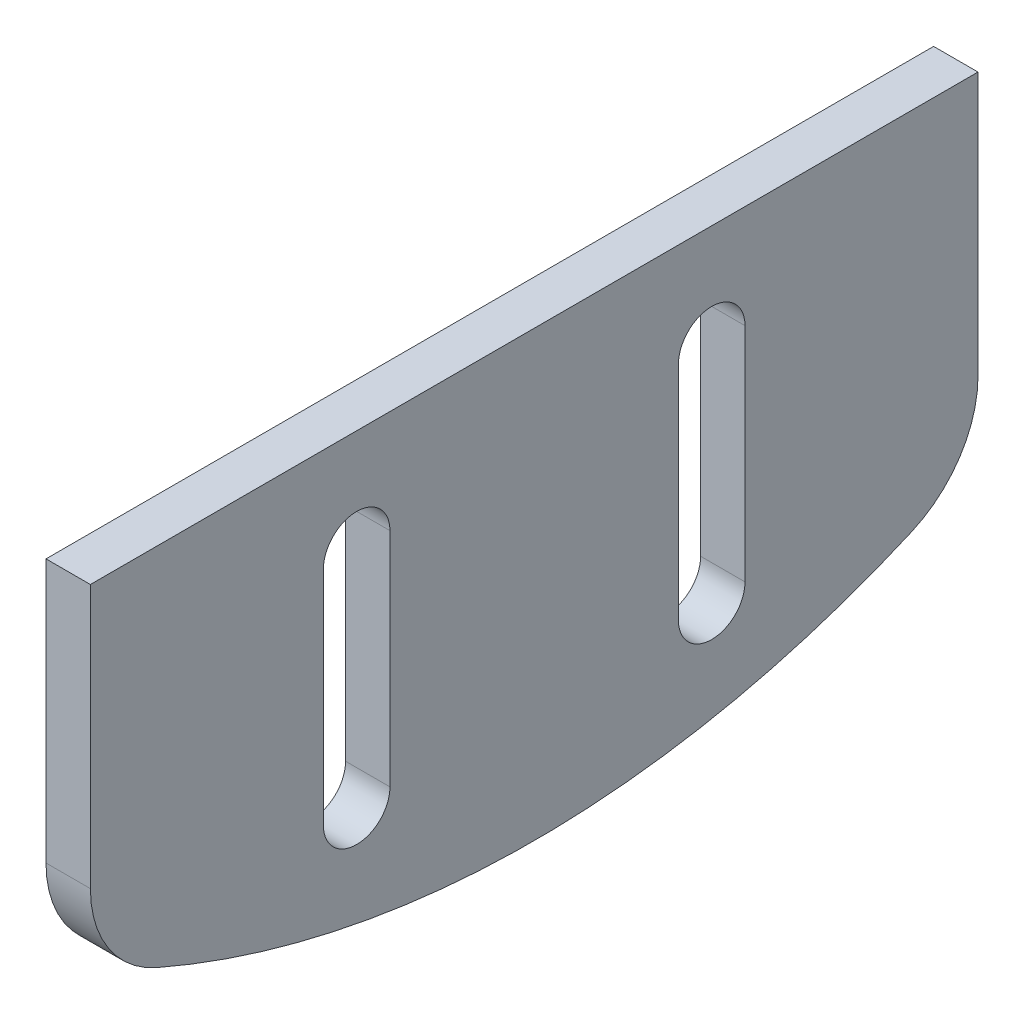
from build123d import *

# Parameters (mm, degrees)
EXTRUDE_1_DEPTH     = 2
CUT_EXTRUDE_1_DEPTH = 2
FILLET_1_R          = 5


with BuildPart() as part:
    # Sketch 1 → Extrude 1 (new body)
    with BuildSketch(Plane(origin=(0, 0, 0), x_dir=(0, 0, -1), z_dir=(1, 0, 0))):
        with BuildLine():
            Line((-20, 5), (-20, 20))
            Line((-20, 20), (20, 20))
            Line((20, 20), (20, 5))
            ThreePointArc((20, 5), (0, 0), (-20, 5))
        make_face()
    extrude(amount=EXTRUDE_1_DEPTH)

    # Sketch 2 → Cut-Extrude 1 (cut)
    with BuildSketch(Plane(origin=(2, 0, 0), x_dir=(0, 0, -1), z_dir=(1, 0, 0))):
        with BuildLine():
            Line((-9.5, 5.351648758), (-9.5, 15.351648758))
            ThreePointArc((-9.5, 15.351648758), (-8, 16.851648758), (-6.5, 15.351648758))
            Line((-6.5, 15.351648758), (-6.5, 5.351648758))
            ThreePointArc((-6.5, 5.351648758), (-8, 3.851648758), (-9.5, 5.351648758))
        make_face()
        with BuildLine():
            Line((9.5, 5.351648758), (9.5, 15.351648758))
            ThreePointArc((9.5, 15.351648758), (8, 16.851648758), (6.5, 15.351648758))
            Line((6.5, 15.351648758), (6.5, 5.351648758))
            ThreePointArc((6.5, 5.351648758), (8, 3.851648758), (9.5, 5.351648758))
        make_face()
    extrude(amount=-CUT_EXTRUDE_1_DEPTH, mode=Mode.SUBTRACT)

    # Fillet 1
    fillet_1_edges = [part.edges().sort_by_distance(p)[0] for p in [
        (1, 5, -20),
        (1, 5, 20),
    ]]
    fillet(fillet_1_edges, radius=FILLET_1_R)


solid = part.part
